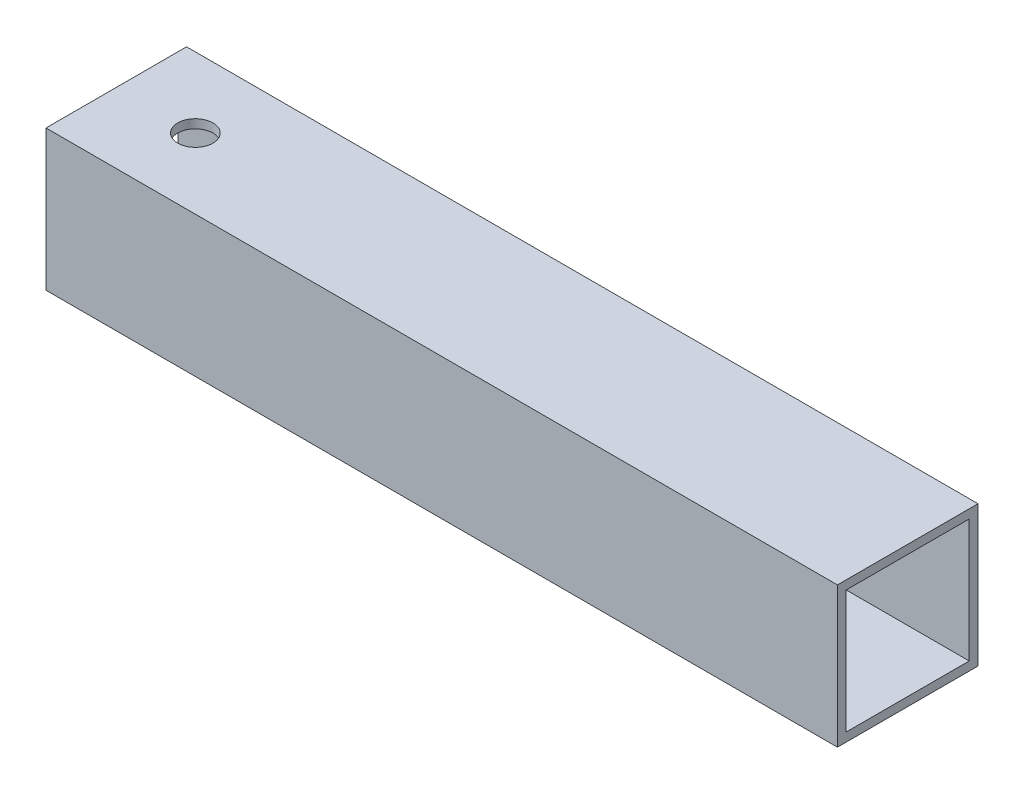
from build123d import *

# Parameters (mm, degrees)
SKETCH1_W           = 25.4
SKETCH1_H           = 25.4
SKETCH1_W_2         = 22.225
SKETCH1_H_2         = 22.225
BOSS_EXTRUDE1_DEPTH = 143.002
SKETCH2_R           = 3.175
CUT_EXTRUDE1_DEPTH  = 143.002


with BuildPart() as part:
    # Sketch1 → Boss-Extrude1 (new body)
    with BuildSketch(Plane(origin=(0, 0, 0), x_dir=(0, 0, -1), z_dir=(1, 0, 0))):
        Rectangle(SKETCH1_W, SKETCH1_H)
        Rectangle(SKETCH1_W_2, SKETCH1_H_2, mode=Mode.SUBTRACT)
    extrude(amount=BOSS_EXTRUDE1_DEPTH)

    # Sketch2 → Cut-Extrude1 (cut)
    with BuildSketch(Plane(origin=(0, 12.7, 0), x_dir=(1, 0, 0), z_dir=(0, 1, 0))):
        with Locations(Location((14.2875, 0, 0), (0, 0, 270))):
            Circle(SKETCH2_R)
    extrude(amount=-CUT_EXTRUDE1_DEPTH, mode=Mode.SUBTRACT)


solid = part.part
